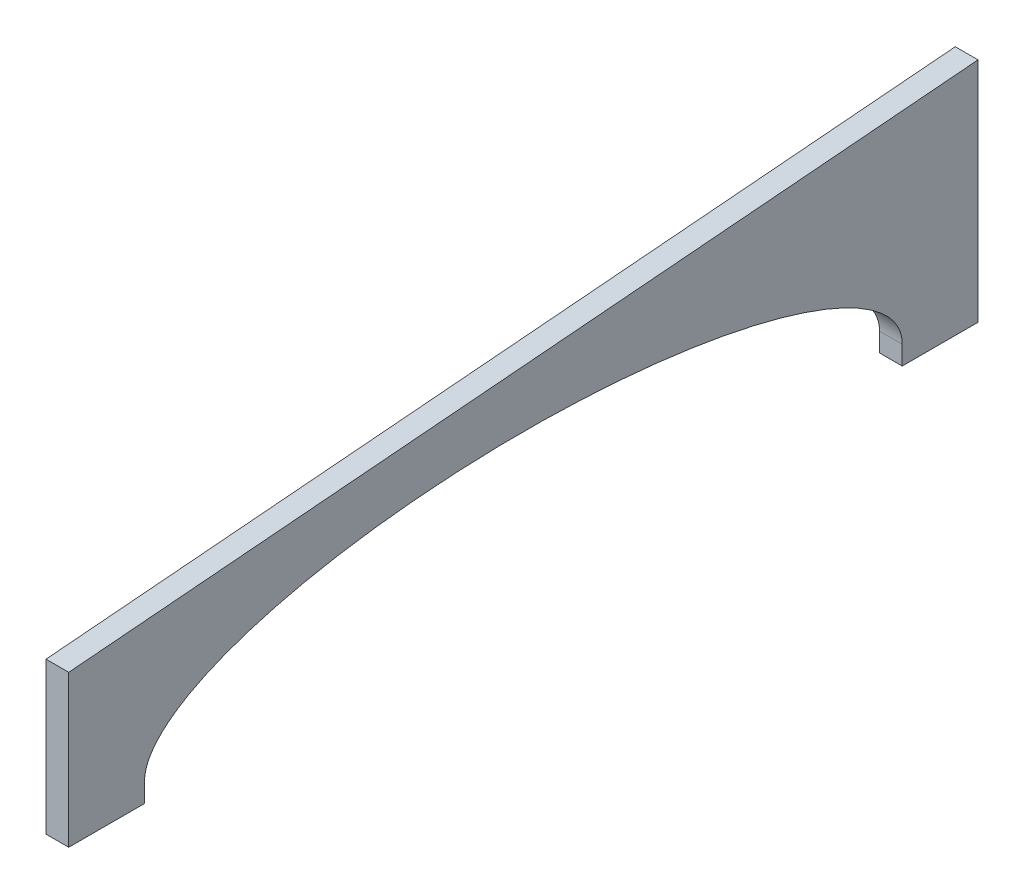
from build123d import *

# Parameters (mm, degrees)
BOSS_EXTRU_1_DEPTH = 6


with BuildPart() as part:
    # Esquisse1 → Boss.-Extru.1 (new body)
    with BuildSketch(Plane(origin=(0, 0, 0), x_dir=(0, 0, -1), z_dir=(1, 0, 0))):
        with BuildLine():
            Line((0, 40), (0, 0))
            Line((0, 0), (20, 0))
            Line((20, 0), (20, 5))
            add(Edge.make_bspline(
                [(220, 5), (220, 35), (120, 35), (20, 35), (20, 5)],
                knots=[3.141592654, 3.141592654, 3.141592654, 4.71238898, 4.71238898, 6.283185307, 6.283185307, 6.283185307], degree=2, weights=[1, 0.707106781, 1, 0.707106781, 1]))
            Line((220, 5), (220, 0))
            Line((220, 0), (240, 0))
            Line((240, 0), (240, 60))
            Line((240, 60), (0, 40))
        make_face()
    extrude(amount=BOSS_EXTRU_1_DEPTH)


solid = part.part
